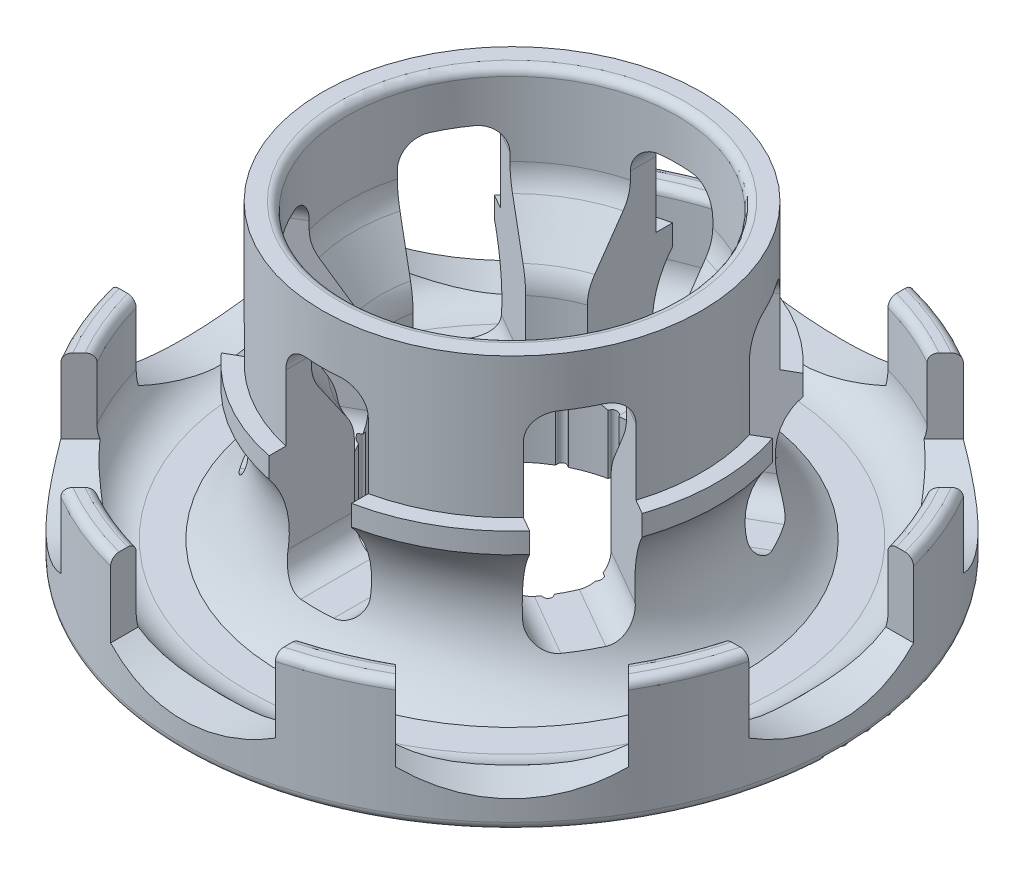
from build123d import *

# Parameters (mm, degrees)
ENL_V_MAT_EXTRU_1_DEPTH      = 35
R_P_TITION_CIRCULAIRE1_COUNT = 6
ENL_V_MAT_EXTRU_2_DEPTH      = 30
R_P_TITION_CIRCULAIRE2_COUNT = 8
ENL_V_MAT_EXTRU_3_DEPTH      = 8
R_P_TITION_CIRCULAIRE3_COUNT = 19


with BuildPart() as part:
    # Esquisse2 → R_volution1 (revolve)
    with BuildSketch(Plane.XY, mode=Mode.PRIVATE) as r_volution1_sk:
        with BuildLine():
            Line((23, 21), (23, 38))
            Line((23, 38), (21, 38))
            ThreePointArc((21, 38), (20.292893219, 37.707106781), (20, 37))
            Line((20, 37), (20, 28.054651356))
            ThreePointArc((20, 28.054651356), (19.785055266, 26.604394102), (19.15870156, 25.278826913))
            Line((19.15870156, 25.278826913), (15.84129844, 20.308739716))
            ThreePointArc((15.84129844, 20.308739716), (15.214944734, 18.983172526), (15, 17.532915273))
            Line((15, 17.532915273), (15, 0))
            Line((15, 0), (39, 0))
            ThreePointArc((39, 0), (39.707106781, 0.292893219), (40, 1))
            Line((40, 1), (40, 14))
            ThreePointArc((40, 14), (39.707106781, 14.707106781), (39, 15))
            Line((39, 15), (38, 15))
            ThreePointArc((38, 15), (37.292893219, 14.707106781), (37, 14))
            Line((37, 14), (37, 7.5))
            ThreePointArc((37, 7.5), (35.535533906, 3.964466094), (32, 2.5))
            Line((32, 2.5), (28, 2.5))
            ThreePointArc((28, 2.5), (22.776008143, 9.809881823), (25, 18.514956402))
            Line((25, 18.514956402), (25, 21))
            Line((25, 21), (23, 21))
        make_face()
    revolve(r_volution1_sk.sketch.rotate(Axis((0, 0, 0), (0, 1, 0)), 90), axis=Axis((0, 0, 0), (0, 1, 0)))

    # Esquisse3 → Enl_v. mat.-Extru.1 (cut)
    with BuildSketch(Plane.XY):
        with BuildLine():
            Line((-2, 32), (2, 32))
            ThreePointArc((2, 32), (4.121320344, 31.121320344), (5, 29))
            Line((5, 29), (5, 10))
            ThreePointArc((5, 10), (4.121320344, 7.878679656), (2, 7))
            Line((2, 7), (-2, 7))
            ThreePointArc((-2, 7), (-4.121320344, 7.878679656), (-5, 10))
            Line((-5, 10), (-5, 29))
            ThreePointArc((-5, 29), (-4.121320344, 31.121320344), (-2, 32))
        make_face()
    enl_v_mat_extru_1 = extrude(amount=-ENL_V_MAT_EXTRU_1_DEPTH, mode=Mode.SUBTRACT)

    # R_p_tition circulaire1: Enl_v. mat.-Extru.1 ×6 about axis
    r_p_tition_circulaire1_axis = Axis((0, 0, 0), (0, 1, 0))
    for i in range(1, R_P_TITION_CIRCULAIRE1_COUNT):
        add(enl_v_mat_extru_1.rotate(r_p_tition_circulaire1_axis, i * 360 / R_P_TITION_CIRCULAIRE1_COUNT), mode=Mode.SUBTRACT)

    # Esquisse4 → Enl_v. mat.-Extru.2 (cut)
    with BuildSketch(Plane.XY.offset(65)):
        with BuildLine():
            Line((-10, 19.237694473), (-10, 5.946912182))
            ThreePointArc((-10, 5.946912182), (0, 3.482096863), (10, 5.946912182))
            Line((10, 5.946912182), (10, 19.237694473))
            Line((10, 19.237694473), (-10, 19.237694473))
        make_face()
    enl_v_mat_extru_2 = extrude(amount=-ENL_V_MAT_EXTRU_2_DEPTH, mode=Mode.SUBTRACT)

    # R_p_tition circulaire2: Enl_v. mat.-Extru.2 ×8 about axis
    r_p_tition_circulaire2_axis = Axis((0, 0, 0), (0, 1, 0))
    for i in range(1, R_P_TITION_CIRCULAIRE2_COUNT):
        add(enl_v_mat_extru_2.rotate(r_p_tition_circulaire2_axis, i * 360 / R_P_TITION_CIRCULAIRE2_COUNT), mode=Mode.SUBTRACT)

    # Esquisse5 → Enl_v. mat.-Extru.3 (cut)
    with BuildSketch(Plane.XZ):
        with BuildLine():
            Line((-0.433012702, 15.25), (-1.154700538, 14))
            Line((-1.154700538, 14), (1.154700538, 14))
            Line((1.154700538, 14), (0.433012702, 15.25))
            ThreePointArc((0.433012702, 15.25), (0, 15.5), (-0.433012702, 15.25))
        make_face()
    enl_v_mat_extru_3 = extrude(amount=-ENL_V_MAT_EXTRU_3_DEPTH, mode=Mode.SUBTRACT)

    # R_p_tition circulaire3: Enl_v. mat.-Extru.3 ×19 about axis
    r_p_tition_circulaire3_axis = Axis((0, 0, 0), (0, 1, 0))
    for i in range(1, R_P_TITION_CIRCULAIRE3_COUNT):
        add(enl_v_mat_extru_3.rotate(r_p_tition_circulaire3_axis, i * 360 / R_P_TITION_CIRCULAIRE3_COUNT), mode=Mode.SUBTRACT)


solid = part.part
